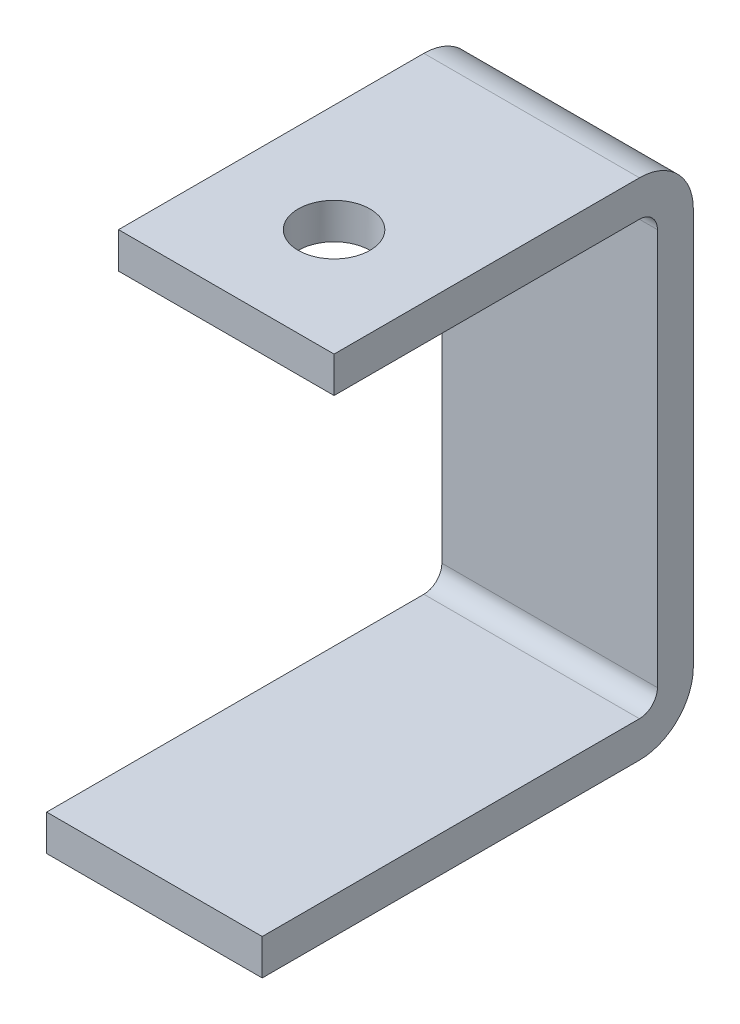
ISO-10303-21;
HEADER;
FILE_DESCRIPTION(('STEP AP214'),'2;1');
FILE_NAME('part.step','',(''),(''),'','','');
FILE_SCHEMA(('AUTOMOTIVE_DESIGN { 1 0 10303 214 1 1 1 1 }'));
ENDSEC;
DATA;
#1=APPLICATION_CONTEXT('core data for automotive mechanical design processes');
#2=APPLICATION_PROTOCOL_DEFINITION('international standard','automotive_design',2000,#1);
#3=PRODUCT_CONTEXT('',#1,'mechanical');
#4=PRODUCT('Part','Part','',(#3));
#5=PRODUCT_RELATED_PRODUCT_CATEGORY('part','',(#4));
#6=PRODUCT_DEFINITION_FORMATION('','',#4);
#7=PRODUCT_DEFINITION_CONTEXT('part definition',#1,'design');
#8=PRODUCT_DEFINITION('design','',#6,#7);
#9=PRODUCT_DEFINITION_SHAPE('','',#8);
#10=(LENGTH_UNIT() NAMED_UNIT(*) SI_UNIT(.MILLI.,.METRE.));
#11=(NAMED_UNIT(*) PLANE_ANGLE_UNIT() SI_UNIT($,.RADIAN.));
#12=(NAMED_UNIT(*) SI_UNIT($,.STERADIAN.) SOLID_ANGLE_UNIT());
#13=UNCERTAINTY_MEASURE_WITH_UNIT(LENGTH_MEASURE(1.E-05),#10,'distance_accuracy_value','');
#14=(GEOMETRIC_REPRESENTATION_CONTEXT(3) GLOBAL_UNCERTAINTY_ASSIGNED_CONTEXT((#13)) GLOBAL_UNIT_ASSIGNED_CONTEXT((#10,
#11,#12)) REPRESENTATION_CONTEXT('',''));
#15=CARTESIAN_POINT('',(0.,0.,0.));
#16=DIRECTION('',(0.,0.,1.));
#17=DIRECTION('',(1.,0.,0.));
#18=AXIS2_PLACEMENT_3D('',#15,#16,#17);
#19=CARTESIAN_POINT('',(19.05,82.804,3.175));
#20=DIRECTION('',(0.,-1.,0.));
#21=DIRECTION('',(0.,0.,-1.));
#22=AXIS2_PLACEMENT_3D('',#19,#20,#21);
#23=PLANE('',#22);
#24=CARTESIAN_POINT('',(0.,82.804,38.1000000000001));
#25=DIRECTION('',(0.,1.,0.));
#26=DIRECTION('',(0.,0.,1.));
#27=AXIS2_PLACEMENT_3D('',#24,#25,#26);
#28=CIRCLE('',#27,6.35);
#29=CARTESIAN_POINT('',(0.,82.804,44.4500000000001));
#30=VERTEX_POINT('',#29);
#31=EDGE_CURVE('E154',#30,#30,#28,.T.);
#32=ORIENTED_EDGE('',*,*,#31,.F.);
#33=EDGE_LOOP('',(#32));
#34=FACE_BOUND('',#33,.T.);
#35=DIRECTION('',(0.,0.,1.));
#36=VECTOR('',#35,1.);
#37=CARTESIAN_POINT('',(-19.05,82.804,3.175));
#38=LINE('',#37,#36);
#39=CARTESIAN_POINT('',(-19.05,82.804,3.175));
#40=VERTEX_POINT('',#39);
#41=CARTESIAN_POINT('',(-19.05,82.804,57.15));
#42=VERTEX_POINT('',#41);
#43=EDGE_CURVE('E150',#40,#42,#38,.T.);
#44=ORIENTED_EDGE('',*,*,#43,.T.);
#45=DIRECTION('',(-1.,0.,0.));
#46=VECTOR('',#45,1.);
#47=CARTESIAN_POINT('',(19.05,82.804,57.15));
#48=LINE('',#47,#46);
#49=CARTESIAN_POINT('',(19.05,82.804,57.15));
#50=VERTEX_POINT('',#49);
#51=EDGE_CURVE('E11',#50,#42,#48,.T.);
#52=ORIENTED_EDGE('',*,*,#51,.F.);
#53=DIRECTION('',(0.,0.,1.));
#54=VECTOR('',#53,1.);
#55=CARTESIAN_POINT('',(19.05,82.804,3.175));
#56=LINE('',#55,#54);
#57=CARTESIAN_POINT('',(19.05,82.804,3.175));
#58=VERTEX_POINT('',#57);
#59=EDGE_CURVE('E98',#58,#50,#56,.T.);
#60=ORIENTED_EDGE('',*,*,#59,.F.);
#61=DIRECTION('',(-1.,0.,0.));
#62=VECTOR('',#61,1.);
#63=CARTESIAN_POINT('',(19.05,82.804,3.175));
#64=LINE('',#63,#62);
#65=EDGE_CURVE('E146',#58,#40,#64,.T.);
#66=ORIENTED_EDGE('',*,*,#65,.T.);
#67=EDGE_LOOP('',(#44,#52,#60,#66));
#68=FACE_BOUND('',#67,.T.);
#69=ADVANCED_FACE('F30',(#34,#68),#23,.F.);
#70=CARTESIAN_POINT('',(19.05,76.454,57.15));
#71=DIRECTION('',(0.,0.,1.));
#72=DIRECTION('',(0.,-1.,0.));
#73=AXIS2_PLACEMENT_3D('',#70,#71,#72);
#74=PLANE('',#73);
#75=DIRECTION('',(0.,1.,0.));
#76=VECTOR('',#75,1.);
#77=CARTESIAN_POINT('',(-19.05,76.454,57.15));
#78=LINE('',#77,#76);
#79=CARTESIAN_POINT('',(-19.05,76.454,57.15));
#80=VERTEX_POINT('',#79);
#81=EDGE_CURVE('E153',#80,#42,#78,.T.);
#82=ORIENTED_EDGE('',*,*,#81,.F.);
#83=DIRECTION('',(-1.,0.,0.));
#84=VECTOR('',#83,1.);
#85=CARTESIAN_POINT('',(19.05,76.454,57.15));
#86=LINE('',#85,#84);
#87=CARTESIAN_POINT('',(19.05,76.454,57.15));
#88=VERTEX_POINT('',#87);
#89=EDGE_CURVE('E38',#88,#80,#86,.T.);
#90=ORIENTED_EDGE('',*,*,#89,.F.);
#91=DIRECTION('',(0.,1.,0.));
#92=VECTOR('',#91,1.);
#93=CARTESIAN_POINT('',(19.05,76.454,57.15));
#94=LINE('',#93,#92);
#95=EDGE_CURVE('E217',#88,#50,#94,.T.);
#96=ORIENTED_EDGE('',*,*,#95,.T.);
#97=ORIENTED_EDGE('',*,*,#51,.T.);
#98=EDGE_LOOP('',(#82,#90,#96,#97));
#99=FACE_BOUND('',#98,.T.);
#100=ADVANCED_FACE('F204',(#99),#74,.T.);
#101=CARTESIAN_POINT('',(19.05,76.454,3.175));
#102=DIRECTION('',(0.,-1.,0.));
#103=DIRECTION('',(0.,0.,-1.));
#104=AXIS2_PLACEMENT_3D('',#101,#102,#103);
#105=PLANE('',#104);
#106=CARTESIAN_POINT('',(0.,76.454,38.1000000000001));
#107=DIRECTION('',(0.,-1.,0.));
#108=DIRECTION('',(0.,0.,-1.));
#109=AXIS2_PLACEMENT_3D('',#106,#107,#108);
#110=CIRCLE('',#109,6.35);
#111=CARTESIAN_POINT('',(0.,76.454,31.7500000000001));
#112=VERTEX_POINT('',#111);
#113=EDGE_CURVE('E280',#112,#112,#110,.F.);
#114=ORIENTED_EDGE('',*,*,#113,.T.);
#115=EDGE_LOOP('',(#114));
#116=FACE_BOUND('',#115,.T.);
#117=DIRECTION('',(0.,0.,1.));
#118=VECTOR('',#117,1.);
#119=CARTESIAN_POINT('',(-19.05,76.454,3.175));
#120=LINE('',#119,#118);
#121=CARTESIAN_POINT('',(-19.05,76.454,3.175));
#122=VERTEX_POINT('',#121);
#123=EDGE_CURVE('E157',#122,#80,#120,.T.);
#124=ORIENTED_EDGE('',*,*,#123,.F.);
#125=DIRECTION('',(-1.,0.,0.));
#126=VECTOR('',#125,1.);
#127=CARTESIAN_POINT('',(19.05,76.454,3.175));
#128=LINE('',#127,#126);
#129=CARTESIAN_POINT('',(19.05,76.454,3.175));
#130=VERTEX_POINT('',#129);
#131=EDGE_CURVE('E194',#130,#122,#128,.T.);
#132=ORIENTED_EDGE('',*,*,#131,.F.);
#133=DIRECTION('',(0.,0.,1.));
#134=VECTOR('',#133,1.);
#135=CARTESIAN_POINT('',(19.05,76.454,3.175));
#136=LINE('',#135,#134);
#137=EDGE_CURVE('E201',#130,#88,#136,.T.);
#138=ORIENTED_EDGE('',*,*,#137,.T.);
#139=ORIENTED_EDGE('',*,*,#89,.T.);
#140=EDGE_LOOP('',(#124,#132,#138,#139));
#141=FACE_BOUND('',#140,.T.);
#142=ADVANCED_FACE('F199',(#116,#141),#105,.T.);
#143=CARTESIAN_POINT('',(19.05,73.279,3.175));
#144=DIRECTION('',(-1.,0.,0.));
#145=DIRECTION('',(0.,0.,1.));
#146=AXIS2_PLACEMENT_3D('',#143,#144,#145);
#147=CYLINDRICAL_SURFACE('',#146,3.175);
#148=CARTESIAN_POINT('',(-19.05,73.279,3.175));
#149=DIRECTION('',(1.,0.,0.));
#150=DIRECTION('',(0.,0.,-1.));
#151=AXIS2_PLACEMENT_3D('',#148,#149,#150);
#152=CIRCLE('',#151,3.175);
#153=CARTESIAN_POINT('',(-19.05,73.279,0.));
#154=VERTEX_POINT('',#153);
#155=EDGE_CURVE('E160',#154,#122,#152,.T.);
#156=ORIENTED_EDGE('',*,*,#155,.F.);
#157=DIRECTION('',(-1.,0.,0.));
#158=VECTOR('',#157,1.);
#159=CARTESIAN_POINT('',(19.05,73.279,0.));
#160=LINE('',#159,#158);
#161=CARTESIAN_POINT('',(19.05,73.279,0.));
#162=VERTEX_POINT('',#161);
#163=EDGE_CURVE('E192',#162,#154,#160,.T.);
#164=ORIENTED_EDGE('',*,*,#163,.F.);
#165=CARTESIAN_POINT('',(19.05,73.279,3.175));
#166=DIRECTION('',(1.,0.,0.));
#167=DIRECTION('',(0.,0.,-1.));
#168=AXIS2_PLACEMENT_3D('',#165,#166,#167);
#169=CIRCLE('',#168,3.175);
#170=EDGE_CURVE('E214',#162,#130,#169,.T.);
#171=ORIENTED_EDGE('',*,*,#170,.T.);
#172=ORIENTED_EDGE('',*,*,#131,.T.);
#173=EDGE_LOOP('',(#156,#164,#171,#172));
#174=FACE_BOUND('',#173,.T.);
#175=ADVANCED_FACE('F211',(#174),#147,.F.);
#176=CARTESIAN_POINT('',(19.05,3.175,0.));
#177=DIRECTION('',(0.,0.,1.));
#178=DIRECTION('',(1.,0.,0.));
#179=AXIS2_PLACEMENT_3D('',#176,#177,#178);
#180=PLANE('',#179);
#181=DIRECTION('',(0.,1.,0.));
#182=VECTOR('',#181,1.);
#183=CARTESIAN_POINT('',(-19.05,3.175,0.));
#184=LINE('',#183,#182);
#185=CARTESIAN_POINT('',(-19.05,3.175,0.));
#186=VERTEX_POINT('',#185);
#187=EDGE_CURVE('E163',#186,#154,#184,.T.);
#188=ORIENTED_EDGE('',*,*,#187,.F.);
#189=DIRECTION('',(-1.,0.,0.));
#190=VECTOR('',#189,1.);
#191=CARTESIAN_POINT('',(19.05,3.175,0.));
#192=LINE('',#191,#190);
#193=CARTESIAN_POINT('',(19.05,3.175,0.));
#194=VERTEX_POINT('',#193);
#195=EDGE_CURVE('E190',#194,#186,#192,.T.);
#196=ORIENTED_EDGE('',*,*,#195,.F.);
#197=DIRECTION('',(0.,1.,0.));
#198=VECTOR('',#197,1.);
#199=CARTESIAN_POINT('',(19.05,3.175,0.));
#200=LINE('',#199,#198);
#201=EDGE_CURVE('E219',#194,#162,#200,.T.);
#202=ORIENTED_EDGE('',*,*,#201,.T.);
#203=ORIENTED_EDGE('',*,*,#163,.T.);
#204=EDGE_LOOP('',(#188,#196,#202,#203));
#205=FACE_BOUND('',#204,.T.);
#206=ADVANCED_FACE('F289',(#205),#180,.T.);
#207=CARTESIAN_POINT('',(19.05,3.175,3.175));
#208=DIRECTION('',(-1.,0.,0.));
#209=DIRECTION('',(0.,0.,1.));
#210=AXIS2_PLACEMENT_3D('',#207,#208,#209);
#211=CYLINDRICAL_SURFACE('',#210,3.175);
#212=CARTESIAN_POINT('',(-19.05,3.175,3.175));
#213=DIRECTION('',(1.,0.,0.));
#214=DIRECTION('',(0.,0.,1.));
#215=AXIS2_PLACEMENT_3D('',#212,#213,#214);
#216=CIRCLE('',#215,3.175);
#217=CARTESIAN_POINT('',(-19.05,0.,3.175));
#218=VERTEX_POINT('',#217);
#219=EDGE_CURVE('E166',#218,#186,#216,.T.);
#220=ORIENTED_EDGE('',*,*,#219,.F.);
#221=DIRECTION('',(-1.,0.,0.));
#222=VECTOR('',#221,1.);
#223=CARTESIAN_POINT('',(19.05,0.,3.175));
#224=LINE('',#223,#222);
#225=CARTESIAN_POINT('',(19.05,0.,3.175));
#226=VERTEX_POINT('',#225);
#227=EDGE_CURVE('E187',#226,#218,#224,.T.);
#228=ORIENTED_EDGE('',*,*,#227,.F.);
#229=CARTESIAN_POINT('',(19.05,3.175,3.175));
#230=DIRECTION('',(1.,0.,0.));
#231=DIRECTION('',(0.,0.,1.));
#232=AXIS2_PLACEMENT_3D('',#229,#230,#231);
#233=CIRCLE('',#232,3.175);
#234=EDGE_CURVE('E225',#226,#194,#233,.T.);
#235=ORIENTED_EDGE('',*,*,#234,.T.);
#236=ORIENTED_EDGE('',*,*,#195,.T.);
#237=EDGE_LOOP('',(#220,#228,#235,#236));
#238=FACE_BOUND('',#237,.T.);
#239=ADVANCED_FACE('F294',(#238),#211,.F.);
#240=CARTESIAN_POINT('',(19.05,0.,69.85));
#241=DIRECTION('',(0.,1.,0.));
#242=DIRECTION('',(0.,0.,1.));
#243=AXIS2_PLACEMENT_3D('',#240,#241,#242);
#244=PLANE('',#243);
#245=DIRECTION('',(0.,0.,-1.));
#246=VECTOR('',#245,1.);
#247=CARTESIAN_POINT('',(-19.05,0.,69.85));
#248=LINE('',#247,#246);
#249=CARTESIAN_POINT('',(-19.05,0.,69.85));
#250=VERTEX_POINT('',#249);
#251=EDGE_CURVE('E169',#250,#218,#248,.T.);
#252=ORIENTED_EDGE('',*,*,#251,.F.);
#253=DIRECTION('',(-1.,0.,0.));
#254=VECTOR('',#253,1.);
#255=CARTESIAN_POINT('',(19.05,0.,69.85));
#256=LINE('',#255,#254);
#257=CARTESIAN_POINT('',(19.05,0.,69.85));
#258=VERTEX_POINT('',#257);
#259=EDGE_CURVE('E185',#258,#250,#256,.T.);
#260=ORIENTED_EDGE('',*,*,#259,.F.);
#261=DIRECTION('',(0.,0.,-1.));
#262=VECTOR('',#261,1.);
#263=CARTESIAN_POINT('',(19.05,0.,44.45));
#264=LINE('',#263,#262);
#265=EDGE_CURVE('E228',#258,#226,#264,.T.);
#266=ORIENTED_EDGE('',*,*,#265,.T.);
#267=ORIENTED_EDGE('',*,*,#227,.T.);
#268=EDGE_LOOP('',(#252,#260,#266,#267));
#269=FACE_BOUND('',#268,.T.);
#270=ADVANCED_FACE('F240',(#269),#244,.T.);
#271=CARTESIAN_POINT('',(19.05,-6.35,69.85));
#272=DIRECTION('',(0.,0.,1.));
#273=DIRECTION('',(1.,0.,0.));
#274=AXIS2_PLACEMENT_3D('',#271,#272,#273);
#275=PLANE('',#274);
#276=DIRECTION('',(0.,1.,0.));
#277=VECTOR('',#276,1.);
#278=CARTESIAN_POINT('',(-19.05,-6.35,69.85));
#279=LINE('',#278,#277);
#280=CARTESIAN_POINT('',(-19.05,-6.35,69.85));
#281=VERTEX_POINT('',#280);
#282=EDGE_CURVE('E171',#281,#250,#279,.T.);
#283=ORIENTED_EDGE('',*,*,#282,.F.);
#284=DIRECTION('',(-1.,0.,0.));
#285=VECTOR('',#284,1.);
#286=CARTESIAN_POINT('',(19.05,-6.35,69.85));
#287=LINE('',#286,#285);
#288=CARTESIAN_POINT('',(19.05,-6.35,69.85));
#289=VERTEX_POINT('',#288);
#290=EDGE_CURVE('E182',#289,#281,#287,.T.);
#291=ORIENTED_EDGE('',*,*,#290,.F.);
#292=DIRECTION('',(0.,1.,0.));
#293=VECTOR('',#292,1.);
#294=CARTESIAN_POINT('',(19.05,-6.35,69.85));
#295=LINE('',#294,#293);
#296=EDGE_CURVE('E231',#289,#258,#295,.T.);
#297=ORIENTED_EDGE('',*,*,#296,.T.);
#298=ORIENTED_EDGE('',*,*,#259,.T.);
#299=EDGE_LOOP('',(#283,#291,#297,#298));
#300=FACE_BOUND('',#299,.T.);
#301=ADVANCED_FACE('F235',(#300),#275,.T.);
#302=CARTESIAN_POINT('',(19.05,-6.35,44.45));
#303=DIRECTION('',(0.,1.,0.));
#304=DIRECTION('',(0.,0.,1.));
#305=AXIS2_PLACEMENT_3D('',#302,#303,#304);
#306=PLANE('',#305);
#307=DIRECTION('',(0.,0.,-1.));
#308=VECTOR('',#307,1.);
#309=CARTESIAN_POINT('',(-19.05,-6.35,44.45));
#310=LINE('',#309,#308);
#311=CARTESIAN_POINT('',(-19.05,-6.35,3.17499999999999));
#312=VERTEX_POINT('',#311);
#313=EDGE_CURVE('E174',#281,#312,#310,.T.);
#314=ORIENTED_EDGE('',*,*,#313,.T.);
#315=DIRECTION('',(-1.,0.,0.));
#316=VECTOR('',#315,1.);
#317=CARTESIAN_POINT('',(19.05,-6.35,3.17499999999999));
#318=LINE('',#317,#316);
#319=CARTESIAN_POINT('',(19.05,-6.35,3.17499999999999));
#320=VERTEX_POINT('',#319);
#321=EDGE_CURVE('E141',#320,#312,#318,.T.);
#322=ORIENTED_EDGE('',*,*,#321,.F.);
#323=DIRECTION('',(0.,0.,-1.));
#324=VECTOR('',#323,1.);
#325=CARTESIAN_POINT('',(19.05,-6.35,69.85));
#326=LINE('',#325,#324);
#327=EDGE_CURVE('E132',#289,#320,#326,.T.);
#328=ORIENTED_EDGE('',*,*,#327,.F.);
#329=ORIENTED_EDGE('',*,*,#290,.T.);
#330=EDGE_LOOP('',(#314,#322,#328,#329));
#331=FACE_BOUND('',#330,.T.);
#332=ADVANCED_FACE('F243',(#331),#306,.F.);
#333=CARTESIAN_POINT('',(19.05,3.175,3.175));
#334=DIRECTION('',(-1.,0.,0.));
#335=DIRECTION('',(0.,0.,1.));
#336=AXIS2_PLACEMENT_3D('',#333,#334,#335);
#337=CYLINDRICAL_SURFACE('',#336,9.525);
#338=CARTESIAN_POINT('',(-19.05,3.175,3.175));
#339=DIRECTION('',(1.,0.,0.));
#340=DIRECTION('',(0.,0.,-1.));
#341=AXIS2_PLACEMENT_3D('',#338,#339,#340);
#342=CIRCLE('',#341,9.525);
#343=CARTESIAN_POINT('',(-19.05,3.175,-6.35));
#344=VERTEX_POINT('',#343);
#345=EDGE_CURVE('E140',#312,#344,#342,.T.);
#346=ORIENTED_EDGE('',*,*,#345,.T.);
#347=DIRECTION('',(-1.,0.,0.));
#348=VECTOR('',#347,1.);
#349=CARTESIAN_POINT('',(19.05,3.175,-6.35));
#350=LINE('',#349,#348);
#351=CARTESIAN_POINT('',(19.05,3.175,-6.35));
#352=VERTEX_POINT('',#351);
#353=EDGE_CURVE('E137',#352,#344,#350,.T.);
#354=ORIENTED_EDGE('',*,*,#353,.F.);
#355=CARTESIAN_POINT('',(19.05,3.175,3.175));
#356=DIRECTION('',(1.,0.,0.));
#357=DIRECTION('',(0.,0.,-1.));
#358=AXIS2_PLACEMENT_3D('',#355,#356,#357);
#359=CIRCLE('',#358,9.525);
#360=EDGE_CURVE('E125',#320,#352,#359,.T.);
#361=ORIENTED_EDGE('',*,*,#360,.F.);
#362=ORIENTED_EDGE('',*,*,#321,.T.);
#363=EDGE_LOOP('',(#346,#354,#361,#362));
#364=FACE_BOUND('',#363,.T.);
#365=ADVANCED_FACE('F138',(#364),#337,.T.);
#366=CARTESIAN_POINT('',(19.05,3.175,-6.35));
#367=DIRECTION('',(0.,0.,1.));
#368=DIRECTION('',(1.,0.,0.));
#369=AXIS2_PLACEMENT_3D('',#366,#367,#368);
#370=PLANE('',#369);
#371=DIRECTION('',(0.,1.,0.));
#372=VECTOR('',#371,1.);
#373=CARTESIAN_POINT('',(-19.05,3.175,-6.35));
#374=LINE('',#373,#372);
#375=CARTESIAN_POINT('',(-19.05,73.279,-6.35));
#376=VERTEX_POINT('',#375);
#377=EDGE_CURVE('E86',#344,#376,#374,.T.);
#378=ORIENTED_EDGE('',*,*,#377,.T.);
#379=DIRECTION('',(-1.,0.,0.));
#380=VECTOR('',#379,1.);
#381=CARTESIAN_POINT('',(19.05,73.279,-6.35));
#382=LINE('',#381,#380);
#383=CARTESIAN_POINT('',(19.05,73.279,-6.35));
#384=VERTEX_POINT('',#383);
#385=EDGE_CURVE('E142',#384,#376,#382,.T.);
#386=ORIENTED_EDGE('',*,*,#385,.F.);
#387=DIRECTION('',(0.,1.,0.));
#388=VECTOR('',#387,1.);
#389=CARTESIAN_POINT('',(19.05,3.175,-6.35));
#390=LINE('',#389,#388);
#391=EDGE_CURVE('E129',#352,#384,#390,.T.);
#392=ORIENTED_EDGE('',*,*,#391,.F.);
#393=ORIENTED_EDGE('',*,*,#353,.T.);
#394=EDGE_LOOP('',(#378,#386,#392,#393));
#395=FACE_BOUND('',#394,.T.);
#396=ADVANCED_FACE('F144',(#395),#370,.F.);
#397=CARTESIAN_POINT('',(19.05,73.279,3.175));
#398=DIRECTION('',(-1.,0.,0.));
#399=DIRECTION('',(0.,0.,1.));
#400=AXIS2_PLACEMENT_3D('',#397,#398,#399);
#401=CYLINDRICAL_SURFACE('',#400,9.525);
#402=CARTESIAN_POINT('',(-19.05,73.279,3.175));
#403=DIRECTION('',(1.,0.,0.));
#404=DIRECTION('',(0.,0.,-1.));
#405=AXIS2_PLACEMENT_3D('',#402,#403,#404);
#406=CIRCLE('',#405,9.525);
#407=EDGE_CURVE('E92',#376,#40,#406,.T.);
#408=ORIENTED_EDGE('',*,*,#407,.T.);
#409=ORIENTED_EDGE('',*,*,#65,.F.);
#410=CARTESIAN_POINT('',(19.05,73.279,3.175));
#411=DIRECTION('',(1.,0.,0.));
#412=DIRECTION('',(0.,0.,-1.));
#413=AXIS2_PLACEMENT_3D('',#410,#411,#412);
#414=CIRCLE('',#413,9.525);
#415=EDGE_CURVE('E46',#384,#58,#414,.T.);
#416=ORIENTED_EDGE('',*,*,#415,.F.);
#417=ORIENTED_EDGE('',*,*,#385,.T.);
#418=EDGE_LOOP('',(#408,#409,#416,#417));
#419=FACE_BOUND('',#418,.T.);
#420=ADVANCED_FACE('F260',(#419),#401,.T.);
#421=CARTESIAN_POINT('',(19.05,73.279,3.175));
#422=DIRECTION('',(1.,0.,0.));
#423=DIRECTION('',(0.,0.,-1.));
#424=AXIS2_PLACEMENT_3D('',#421,#422,#423);
#425=PLANE('',#424);
#426=ORIENTED_EDGE('',*,*,#59,.T.);
#427=ORIENTED_EDGE('',*,*,#95,.F.);
#428=ORIENTED_EDGE('',*,*,#137,.F.);
#429=ORIENTED_EDGE('',*,*,#170,.F.);
#430=ORIENTED_EDGE('',*,*,#201,.F.);
#431=ORIENTED_EDGE('',*,*,#234,.F.);
#432=ORIENTED_EDGE('',*,*,#265,.F.);
#433=ORIENTED_EDGE('',*,*,#296,.F.);
#434=ORIENTED_EDGE('',*,*,#327,.T.);
#435=ORIENTED_EDGE('',*,*,#360,.T.);
#436=ORIENTED_EDGE('',*,*,#391,.T.);
#437=ORIENTED_EDGE('',*,*,#415,.T.);
#438=EDGE_LOOP('',(#426,#427,#428,#429,#430,#431,#432,#433,#434,#435,#436,#437));
#439=FACE_BOUND('',#438,.T.);
#440=ADVANCED_FACE('F127',(#439),#425,.T.);
#441=CARTESIAN_POINT('',(-19.05,73.279,3.175));
#442=DIRECTION('',(1.,0.,0.));
#443=DIRECTION('',(0.,0.,-1.));
#444=AXIS2_PLACEMENT_3D('',#441,#442,#443);
#445=PLANE('',#444);
#446=ORIENTED_EDGE('',*,*,#43,.F.);
#447=ORIENTED_EDGE('',*,*,#407,.F.);
#448=ORIENTED_EDGE('',*,*,#377,.F.);
#449=ORIENTED_EDGE('',*,*,#345,.F.);
#450=ORIENTED_EDGE('',*,*,#313,.F.);
#451=ORIENTED_EDGE('',*,*,#282,.T.);
#452=ORIENTED_EDGE('',*,*,#251,.T.);
#453=ORIENTED_EDGE('',*,*,#219,.T.);
#454=ORIENTED_EDGE('',*,*,#187,.T.);
#455=ORIENTED_EDGE('',*,*,#155,.T.);
#456=ORIENTED_EDGE('',*,*,#123,.T.);
#457=ORIENTED_EDGE('',*,*,#81,.T.);
#458=EDGE_LOOP('',(#446,#447,#448,#449,#450,#451,#452,#453,#454,#455,#456,#457));
#459=FACE_BOUND('',#458,.T.);
#460=ADVANCED_FACE('F207',(#459),#445,.F.);
#461=CARTESIAN_POINT('',(0.,-6.35100000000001,38.1000000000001));
#462=DIRECTION('',(0.,1.,0.));
#463=DIRECTION('',(0.,0.,1.));
#464=AXIS2_PLACEMENT_3D('',#461,#462,#463);
#465=CYLINDRICAL_SURFACE('',#464,6.35);
#466=ORIENTED_EDGE('',*,*,#113,.F.);
#467=EDGE_LOOP('',(#466));
#468=FACE_BOUND('',#467,.T.);
#469=ORIENTED_EDGE('',*,*,#31,.T.);
#470=EDGE_LOOP('',(#469));
#471=FACE_BOUND('',#470,.T.);
#472=ADVANCED_FACE('F271',(#468,#471),#465,.F.);
#473=CLOSED_SHELL('',(#69,#100,#142,#175,#206,#239,#270,#301,#332,#365,#396,#420,#440,#460,#472));
#474=MANIFOLD_SOLID_BREP('B2',#473);
#475=ADVANCED_BREP_SHAPE_REPRESENTATION('',(#18,#474),#14);
#476=SHAPE_DEFINITION_REPRESENTATION(#9,#475);
ENDSEC;
END-ISO-10303-21;
